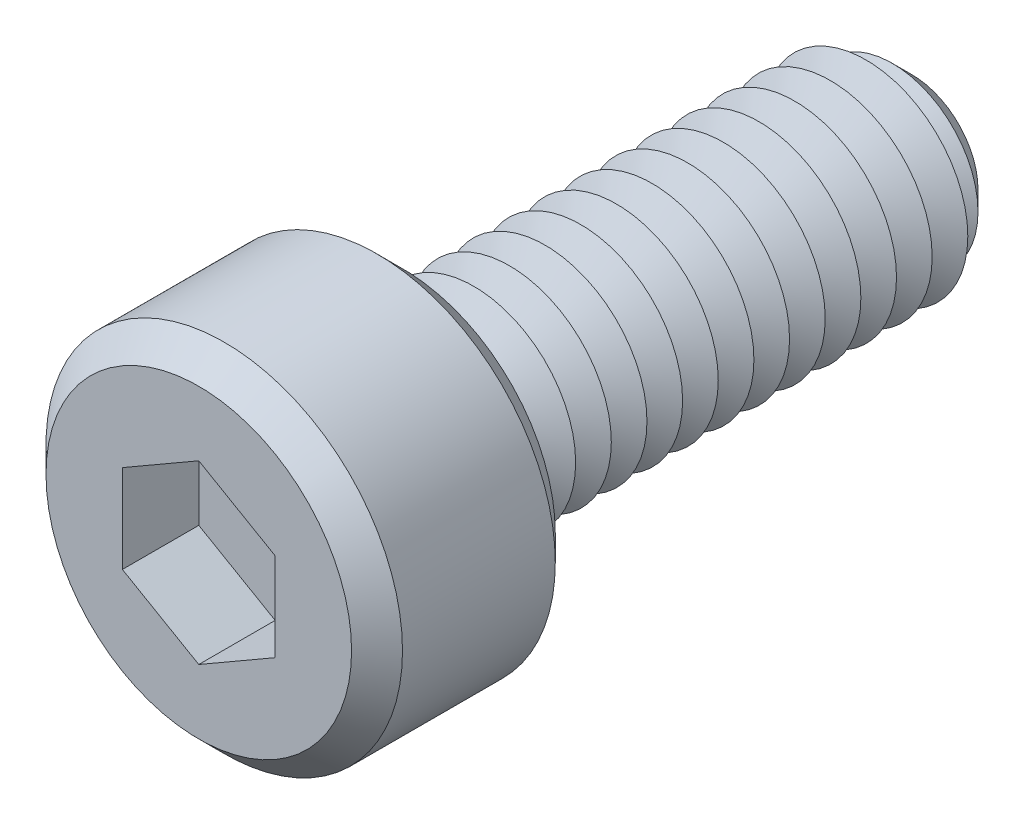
ISO-10303-21;
HEADER;
FILE_DESCRIPTION(('STEP AP214'),'2;1');
FILE_NAME('part.step','',(''),(''),'','','');
FILE_SCHEMA(('AUTOMOTIVE_DESIGN { 1 0 10303 214 1 1 1 1 }'));
ENDSEC;
DATA;
#1=APPLICATION_CONTEXT('core data for automotive mechanical design processes');
#2=APPLICATION_PROTOCOL_DEFINITION('international standard','automotive_design',2000,#1);
#3=PRODUCT_CONTEXT('',#1,'mechanical');
#4=PRODUCT('Part','Part','',(#3));
#5=PRODUCT_RELATED_PRODUCT_CATEGORY('part','',(#4));
#6=PRODUCT_DEFINITION_FORMATION('','',#4);
#7=PRODUCT_DEFINITION_CONTEXT('part definition',#1,'design');
#8=PRODUCT_DEFINITION('design','',#6,#7);
#9=PRODUCT_DEFINITION_SHAPE('','',#8);
#10=(LENGTH_UNIT() NAMED_UNIT(*) SI_UNIT(.MILLI.,.METRE.));
#11=(NAMED_UNIT(*) PLANE_ANGLE_UNIT() SI_UNIT($,.RADIAN.));
#12=(NAMED_UNIT(*) SI_UNIT($,.STERADIAN.) SOLID_ANGLE_UNIT());
#13=UNCERTAINTY_MEASURE_WITH_UNIT(LENGTH_MEASURE(1.E-05),#10,'distance_accuracy_value','');
#14=(GEOMETRIC_REPRESENTATION_CONTEXT(3) GLOBAL_UNCERTAINTY_ASSIGNED_CONTEXT((#13)) GLOBAL_UNIT_ASSIGNED_CONTEXT((#10,
#11,#12)) REPRESENTATION_CONTEXT('',''));
#15=CARTESIAN_POINT('',(0.,0.,0.));
#16=DIRECTION('',(0.,0.,1.));
#17=DIRECTION('',(1.,0.,0.));
#18=AXIS2_PLACEMENT_3D('',#15,#16,#17);
#19=CARTESIAN_POINT('',(0.,0.,4.));
#20=DIRECTION('',(0.,0.,-1.));
#21=DIRECTION('',(-1.,0.,0.));
#22=AXIS2_PLACEMENT_3D('',#19,#20,#21);
#23=CYLINDRICAL_SURFACE('',#22,3.5);
#24=CARTESIAN_POINT('',(0.,0.,0.500000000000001));
#25=DIRECTION('',(0.,0.,1.));
#26=DIRECTION('',(1.,0.,0.));
#27=AXIS2_PLACEMENT_3D('',#24,#25,#26);
#28=CIRCLE('',#27,3.5);
#29=CARTESIAN_POINT('',(3.5,0.,0.500000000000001));
#30=VERTEX_POINT('',#29);
#31=EDGE_CURVE('E289',#30,#30,#28,.T.);
#32=ORIENTED_EDGE('',*,*,#31,.T.);
#33=EDGE_LOOP('',(#32));
#34=FACE_BOUND('',#33,.T.);
#35=CARTESIAN_POINT('',(0.,0.,3.5));
#36=DIRECTION('',(0.,0.,1.));
#37=DIRECTION('',(1.,0.,0.));
#38=AXIS2_PLACEMENT_3D('',#35,#36,#37);
#39=CIRCLE('',#38,3.5);
#40=CARTESIAN_POINT('',(3.5,0.,3.5));
#41=VERTEX_POINT('',#40);
#42=EDGE_CURVE('E282',#41,#41,#39,.F.);
#43=ORIENTED_EDGE('',*,*,#42,.T.);
#44=EDGE_LOOP('',(#43));
#45=FACE_BOUND('',#44,.T.);
#46=ADVANCED_FACE('F39',(#34,#45),#23,.T.);
#47=CARTESIAN_POINT('',(0.,0.,4.));
#48=DIRECTION('',(0.,0.,1.));
#49=DIRECTION('',(1.,0.,0.));
#50=AXIS2_PLACEMENT_3D('',#47,#48,#49);
#51=PLANE('',#50);
#52=CARTESIAN_POINT('',(0.,0.,4.));
#53=DIRECTION('',(0.,0.,1.));
#54=DIRECTION('',(1.,0.,0.));
#55=AXIS2_PLACEMENT_3D('',#52,#53,#54);
#56=CIRCLE('',#55,3.);
#57=CARTESIAN_POINT('',(3.,0.,4.));
#58=VERTEX_POINT('',#57);
#59=EDGE_CURVE('E11',#58,#58,#56,.T.);
#60=ORIENTED_EDGE('',*,*,#59,.T.);
#61=EDGE_LOOP('',(#60));
#62=FACE_BOUND('',#61,.T.);
#63=DIRECTION('',(-0.866025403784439,0.5,0.));
#64=VECTOR('',#63,1.);
#65=CARTESIAN_POINT('',(1.5,0.866025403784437,4.));
#66=LINE('',#65,#64);
#67=CARTESIAN_POINT('',(1.5,0.866025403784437,4.));
#68=VERTEX_POINT('',#67);
#69=CARTESIAN_POINT('',(0.,1.73205080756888,4.));
#70=VERTEX_POINT('',#69);
#71=EDGE_CURVE('E55',#68,#70,#66,.T.);
#72=ORIENTED_EDGE('',*,*,#71,.F.);
#73=DIRECTION('',(0.,1.,0.));
#74=VECTOR('',#73,1.);
#75=CARTESIAN_POINT('',(1.5,-0.866025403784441,4.));
#76=LINE('',#75,#74);
#77=CARTESIAN_POINT('',(1.5,-0.866025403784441,4.));
#78=VERTEX_POINT('',#77);
#79=EDGE_CURVE('E151',#78,#68,#76,.T.);
#80=ORIENTED_EDGE('',*,*,#79,.F.);
#81=DIRECTION('',(0.866025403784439,0.5,0.));
#82=VECTOR('',#81,1.);
#83=CARTESIAN_POINT('',(0.,-1.73205080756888,4.));
#84=LINE('',#83,#82);
#85=CARTESIAN_POINT('',(0.,-1.73205080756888,4.));
#86=VERTEX_POINT('',#85);
#87=EDGE_CURVE('E148',#86,#78,#84,.T.);
#88=ORIENTED_EDGE('',*,*,#87,.F.);
#89=DIRECTION('',(0.866025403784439,-0.5,0.));
#90=VECTOR('',#89,1.);
#91=CARTESIAN_POINT('',(-1.5,-0.86602540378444,4.));
#92=LINE('',#91,#90);
#93=CARTESIAN_POINT('',(-1.5,-0.86602540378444,4.));
#94=VERTEX_POINT('',#93);
#95=EDGE_CURVE('E103',#94,#86,#92,.T.);
#96=ORIENTED_EDGE('',*,*,#95,.F.);
#97=DIRECTION('',(0.,-1.,0.));
#98=VECTOR('',#97,1.);
#99=CARTESIAN_POINT('',(-1.5,0.866025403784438,4.));
#100=LINE('',#99,#98);
#101=CARTESIAN_POINT('',(-1.5,0.866025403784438,4.));
#102=VERTEX_POINT('',#101);
#103=EDGE_CURVE('E142',#102,#94,#100,.T.);
#104=ORIENTED_EDGE('',*,*,#103,.F.);
#105=DIRECTION('',(-0.866025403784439,-0.5,0.));
#106=VECTOR('',#105,1.);
#107=CARTESIAN_POINT('',(0.,1.73205080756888,4.));
#108=LINE('',#107,#106);
#109=EDGE_CURVE('E137',#70,#102,#108,.T.);
#110=ORIENTED_EDGE('',*,*,#109,.F.);
#111=EDGE_LOOP('',(#72,#80,#88,#96,#104,#110));
#112=FACE_BOUND('',#111,.T.);
#113=ADVANCED_FACE('F306',(#62,#112),#51,.T.);
#114=CARTESIAN_POINT('',(0.,0.,0.));
#115=DIRECTION('',(0.,0.,1.));
#116=DIRECTION('',(1.,0.,0.));
#117=AXIS2_PLACEMENT_3D('',#114,#115,#116);
#118=PLANE('',#117);
#119=CARTESIAN_POINT('',(0.,0.,0.));
#120=DIRECTION('',(0.,0.,1.));
#121=DIRECTION('',(1.,0.,0.));
#122=AXIS2_PLACEMENT_3D('',#119,#120,#121);
#123=CIRCLE('',#122,3.);
#124=CARTESIAN_POINT('',(3.,0.,0.));
#125=VERTEX_POINT('',#124);
#126=EDGE_CURVE('E48',#125,#125,#123,.F.);
#127=ORIENTED_EDGE('',*,*,#126,.T.);
#128=EDGE_LOOP('',(#127));
#129=FACE_BOUND('',#128,.T.);
#130=CARTESIAN_POINT('',(0.,0.,0.));
#131=DIRECTION('',(0.,0.,1.));
#132=DIRECTION('',(1.,0.,0.));
#133=AXIS2_PLACEMENT_3D('',#130,#131,#132);
#134=CIRCLE('',#133,2.);
#135=CARTESIAN_POINT('',(2.,0.,0.));
#136=VERTEX_POINT('',#135);
#137=EDGE_CURVE('E274',#136,#136,#134,.T.);
#138=ORIENTED_EDGE('',*,*,#137,.T.);
#139=EDGE_LOOP('',(#138));
#140=FACE_BOUND('',#139,.T.);
#141=ADVANCED_FACE('F295',(#129,#140),#118,.F.);
#142=CARTESIAN_POINT('',(0.,0.,0.));
#143=DIRECTION('',(0.,0.,1.));
#144=DIRECTION('',(1.,0.,0.));
#145=AXIS2_PLACEMENT_3D('',#142,#143,#144);
#146=CONICAL_SURFACE('',#145,2.,1.0471975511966);
#147=CARTESIAN_POINT('',(0.,0.,-0.35));
#148=DIRECTION('',(0.,0.,1.));
#149=DIRECTION('',(1.,0.,0.));
#150=AXIS2_PLACEMENT_3D('',#147,#148,#149);
#151=CIRCLE('',#150,1.39378221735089);
#152=CARTESIAN_POINT('',(1.39378221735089,0.,-0.35));
#153=VERTEX_POINT('',#152);
#154=EDGE_CURVE('E270',#153,#153,#151,.T.);
#155=ORIENTED_EDGE('',*,*,#154,.T.);
#156=EDGE_LOOP('',(#155));
#157=FACE_BOUND('',#156,.T.);
#158=ORIENTED_EDGE('',*,*,#137,.F.);
#159=EDGE_LOOP('',(#158));
#160=FACE_BOUND('',#159,.T.);
#161=ADVANCED_FACE('F468',(#157,#160),#146,.T.);
#162=CARTESIAN_POINT('',(0.,0.,-0.35));
#163=DIRECTION('',(0.,0.,-1.));
#164=DIRECTION('',(-1.,0.,0.));
#165=AXIS2_PLACEMENT_3D('',#162,#163,#164);
#166=CONICAL_SURFACE('',#165,1.39378221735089,1.0471975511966);
#167=CARTESIAN_POINT('',(0.,0.,-0.7));
#168=DIRECTION('',(0.,0.,1.));
#169=DIRECTION('',(1.,0.,0.));
#170=AXIS2_PLACEMENT_3D('',#167,#168,#169);
#171=CIRCLE('',#170,2.);
#172=CARTESIAN_POINT('',(2.,0.,-0.7));
#173=VERTEX_POINT('',#172);
#174=EDGE_CURVE('E266',#173,#173,#171,.T.);
#175=ORIENTED_EDGE('',*,*,#174,.T.);
#176=EDGE_LOOP('',(#175));
#177=FACE_BOUND('',#176,.T.);
#178=ORIENTED_EDGE('',*,*,#154,.F.);
#179=EDGE_LOOP('',(#178));
#180=FACE_BOUND('',#179,.T.);
#181=ADVANCED_FACE('F464',(#177,#180),#166,.T.);
#182=CARTESIAN_POINT('',(0.,0.,-0.7));
#183=DIRECTION('',(0.,0.,1.));
#184=DIRECTION('',(1.,0.,0.));
#185=AXIS2_PLACEMENT_3D('',#182,#183,#184);
#186=CONICAL_SURFACE('',#185,2.,1.0471975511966);
#187=CARTESIAN_POINT('',(0.,0.,-1.05));
#188=DIRECTION('',(0.,0.,1.));
#189=DIRECTION('',(1.,0.,0.));
#190=AXIS2_PLACEMENT_3D('',#187,#188,#189);
#191=CIRCLE('',#190,1.39378221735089);
#192=CARTESIAN_POINT('',(1.39378221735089,0.,-1.05));
#193=VERTEX_POINT('',#192);
#194=EDGE_CURVE('E262',#193,#193,#191,.T.);
#195=ORIENTED_EDGE('',*,*,#194,.T.);
#196=EDGE_LOOP('',(#195));
#197=FACE_BOUND('',#196,.T.);
#198=ORIENTED_EDGE('',*,*,#174,.F.);
#199=EDGE_LOOP('',(#198));
#200=FACE_BOUND('',#199,.T.);
#201=ADVANCED_FACE('F460',(#197,#200),#186,.T.);
#202=CARTESIAN_POINT('',(0.,0.,-1.05));
#203=DIRECTION('',(0.,0.,-1.));
#204=DIRECTION('',(-1.,0.,0.));
#205=AXIS2_PLACEMENT_3D('',#202,#203,#204);
#206=CONICAL_SURFACE('',#205,1.39378221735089,1.0471975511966);
#207=CARTESIAN_POINT('',(0.,0.,-1.4));
#208=DIRECTION('',(0.,0.,1.));
#209=DIRECTION('',(1.,0.,0.));
#210=AXIS2_PLACEMENT_3D('',#207,#208,#209);
#211=CIRCLE('',#210,2.);
#212=CARTESIAN_POINT('',(2.,0.,-1.4));
#213=VERTEX_POINT('',#212);
#214=EDGE_CURVE('E258',#213,#213,#211,.T.);
#215=ORIENTED_EDGE('',*,*,#214,.T.);
#216=EDGE_LOOP('',(#215));
#217=FACE_BOUND('',#216,.T.);
#218=ORIENTED_EDGE('',*,*,#194,.F.);
#219=EDGE_LOOP('',(#218));
#220=FACE_BOUND('',#219,.T.);
#221=ADVANCED_FACE('F456',(#217,#220),#206,.T.);
#222=CARTESIAN_POINT('',(0.,0.,-1.4));
#223=DIRECTION('',(0.,0.,1.));
#224=DIRECTION('',(1.,0.,0.));
#225=AXIS2_PLACEMENT_3D('',#222,#223,#224);
#226=CONICAL_SURFACE('',#225,2.,1.0471975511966);
#227=CARTESIAN_POINT('',(0.,0.,-1.75));
#228=DIRECTION('',(0.,0.,1.));
#229=DIRECTION('',(1.,0.,0.));
#230=AXIS2_PLACEMENT_3D('',#227,#228,#229);
#231=CIRCLE('',#230,1.39378221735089);
#232=CARTESIAN_POINT('',(1.39378221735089,0.,-1.75));
#233=VERTEX_POINT('',#232);
#234=EDGE_CURVE('E254',#233,#233,#231,.T.);
#235=ORIENTED_EDGE('',*,*,#234,.T.);
#236=EDGE_LOOP('',(#235));
#237=FACE_BOUND('',#236,.T.);
#238=ORIENTED_EDGE('',*,*,#214,.F.);
#239=EDGE_LOOP('',(#238));
#240=FACE_BOUND('',#239,.T.);
#241=ADVANCED_FACE('F452',(#237,#240),#226,.T.);
#242=CARTESIAN_POINT('',(0.,0.,-1.75));
#243=DIRECTION('',(0.,0.,-1.));
#244=DIRECTION('',(-1.,0.,0.));
#245=AXIS2_PLACEMENT_3D('',#242,#243,#244);
#246=CONICAL_SURFACE('',#245,1.39378221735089,1.0471975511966);
#247=CARTESIAN_POINT('',(0.,0.,-2.1));
#248=DIRECTION('',(0.,0.,1.));
#249=DIRECTION('',(1.,0.,0.));
#250=AXIS2_PLACEMENT_3D('',#247,#248,#249);
#251=CIRCLE('',#250,2.);
#252=CARTESIAN_POINT('',(2.,0.,-2.1));
#253=VERTEX_POINT('',#252);
#254=EDGE_CURVE('E250',#253,#253,#251,.T.);
#255=ORIENTED_EDGE('',*,*,#254,.T.);
#256=EDGE_LOOP('',(#255));
#257=FACE_BOUND('',#256,.T.);
#258=ORIENTED_EDGE('',*,*,#234,.F.);
#259=EDGE_LOOP('',(#258));
#260=FACE_BOUND('',#259,.T.);
#261=ADVANCED_FACE('F448',(#257,#260),#246,.T.);
#262=CARTESIAN_POINT('',(0.,0.,-2.1));
#263=DIRECTION('',(0.,0.,1.));
#264=DIRECTION('',(1.,0.,0.));
#265=AXIS2_PLACEMENT_3D('',#262,#263,#264);
#266=CONICAL_SURFACE('',#265,2.,1.0471975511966);
#267=CARTESIAN_POINT('',(0.,0.,-2.45));
#268=DIRECTION('',(0.,0.,1.));
#269=DIRECTION('',(1.,0.,0.));
#270=AXIS2_PLACEMENT_3D('',#267,#268,#269);
#271=CIRCLE('',#270,1.39378221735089);
#272=CARTESIAN_POINT('',(1.39378221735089,0.,-2.45));
#273=VERTEX_POINT('',#272);
#274=EDGE_CURVE('E246',#273,#273,#271,.T.);
#275=ORIENTED_EDGE('',*,*,#274,.T.);
#276=EDGE_LOOP('',(#275));
#277=FACE_BOUND('',#276,.T.);
#278=ORIENTED_EDGE('',*,*,#254,.F.);
#279=EDGE_LOOP('',(#278));
#280=FACE_BOUND('',#279,.T.);
#281=ADVANCED_FACE('F444',(#277,#280),#266,.T.);
#282=CARTESIAN_POINT('',(0.,0.,-2.45));
#283=DIRECTION('',(0.,0.,-1.));
#284=DIRECTION('',(-1.,0.,0.));
#285=AXIS2_PLACEMENT_3D('',#282,#283,#284);
#286=CONICAL_SURFACE('',#285,1.39378221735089,1.0471975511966);
#287=CARTESIAN_POINT('',(0.,0.,-2.8));
#288=DIRECTION('',(0.,0.,1.));
#289=DIRECTION('',(1.,0.,0.));
#290=AXIS2_PLACEMENT_3D('',#287,#288,#289);
#291=CIRCLE('',#290,2.);
#292=CARTESIAN_POINT('',(2.,0.,-2.8));
#293=VERTEX_POINT('',#292);
#294=EDGE_CURVE('E242',#293,#293,#291,.T.);
#295=ORIENTED_EDGE('',*,*,#294,.T.);
#296=EDGE_LOOP('',(#295));
#297=FACE_BOUND('',#296,.T.);
#298=ORIENTED_EDGE('',*,*,#274,.F.);
#299=EDGE_LOOP('',(#298));
#300=FACE_BOUND('',#299,.T.);
#301=ADVANCED_FACE('F440',(#297,#300),#286,.T.);
#302=CARTESIAN_POINT('',(0.,0.,-2.8));
#303=DIRECTION('',(0.,0.,1.));
#304=DIRECTION('',(1.,0.,0.));
#305=AXIS2_PLACEMENT_3D('',#302,#303,#304);
#306=CONICAL_SURFACE('',#305,2.,1.0471975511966);
#307=CARTESIAN_POINT('',(0.,0.,-3.15));
#308=DIRECTION('',(0.,0.,1.));
#309=DIRECTION('',(1.,0.,0.));
#310=AXIS2_PLACEMENT_3D('',#307,#308,#309);
#311=CIRCLE('',#310,1.39378221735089);
#312=CARTESIAN_POINT('',(1.39378221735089,0.,-3.15));
#313=VERTEX_POINT('',#312);
#314=EDGE_CURVE('E238',#313,#313,#311,.T.);
#315=ORIENTED_EDGE('',*,*,#314,.T.);
#316=EDGE_LOOP('',(#315));
#317=FACE_BOUND('',#316,.T.);
#318=ORIENTED_EDGE('',*,*,#294,.F.);
#319=EDGE_LOOP('',(#318));
#320=FACE_BOUND('',#319,.T.);
#321=ADVANCED_FACE('F436',(#317,#320),#306,.T.);
#322=CARTESIAN_POINT('',(0.,0.,-3.15));
#323=DIRECTION('',(0.,0.,-1.));
#324=DIRECTION('',(-1.,0.,0.));
#325=AXIS2_PLACEMENT_3D('',#322,#323,#324);
#326=CONICAL_SURFACE('',#325,1.39378221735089,1.0471975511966);
#327=CARTESIAN_POINT('',(0.,0.,-3.5));
#328=DIRECTION('',(0.,0.,1.));
#329=DIRECTION('',(1.,0.,0.));
#330=AXIS2_PLACEMENT_3D('',#327,#328,#329);
#331=CIRCLE('',#330,2.);
#332=CARTESIAN_POINT('',(2.,0.,-3.5));
#333=VERTEX_POINT('',#332);
#334=EDGE_CURVE('E234',#333,#333,#331,.T.);
#335=ORIENTED_EDGE('',*,*,#334,.T.);
#336=EDGE_LOOP('',(#335));
#337=FACE_BOUND('',#336,.T.);
#338=ORIENTED_EDGE('',*,*,#314,.F.);
#339=EDGE_LOOP('',(#338));
#340=FACE_BOUND('',#339,.T.);
#341=ADVANCED_FACE('F432',(#337,#340),#326,.T.);
#342=CARTESIAN_POINT('',(0.,0.,-3.5));
#343=DIRECTION('',(0.,0.,1.));
#344=DIRECTION('',(1.,0.,0.));
#345=AXIS2_PLACEMENT_3D('',#342,#343,#344);
#346=CONICAL_SURFACE('',#345,2.,1.0471975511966);
#347=CARTESIAN_POINT('',(0.,0.,-3.85));
#348=DIRECTION('',(0.,0.,1.));
#349=DIRECTION('',(1.,0.,0.));
#350=AXIS2_PLACEMENT_3D('',#347,#348,#349);
#351=CIRCLE('',#350,1.39378221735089);
#352=CARTESIAN_POINT('',(1.39378221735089,0.,-3.85));
#353=VERTEX_POINT('',#352);
#354=EDGE_CURVE('E230',#353,#353,#351,.T.);
#355=ORIENTED_EDGE('',*,*,#354,.T.);
#356=EDGE_LOOP('',(#355));
#357=FACE_BOUND('',#356,.T.);
#358=ORIENTED_EDGE('',*,*,#334,.F.);
#359=EDGE_LOOP('',(#358));
#360=FACE_BOUND('',#359,.T.);
#361=ADVANCED_FACE('F428',(#357,#360),#346,.T.);
#362=CARTESIAN_POINT('',(0.,0.,-3.85));
#363=DIRECTION('',(0.,0.,-1.));
#364=DIRECTION('',(-1.,0.,0.));
#365=AXIS2_PLACEMENT_3D('',#362,#363,#364);
#366=CONICAL_SURFACE('',#365,1.39378221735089,1.0471975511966);
#367=CARTESIAN_POINT('',(0.,0.,-4.2));
#368=DIRECTION('',(0.,0.,1.));
#369=DIRECTION('',(1.,0.,0.));
#370=AXIS2_PLACEMENT_3D('',#367,#368,#369);
#371=CIRCLE('',#370,2.);
#372=CARTESIAN_POINT('',(2.,0.,-4.2));
#373=VERTEX_POINT('',#372);
#374=EDGE_CURVE('E226',#373,#373,#371,.T.);
#375=ORIENTED_EDGE('',*,*,#374,.T.);
#376=EDGE_LOOP('',(#375));
#377=FACE_BOUND('',#376,.T.);
#378=ORIENTED_EDGE('',*,*,#354,.F.);
#379=EDGE_LOOP('',(#378));
#380=FACE_BOUND('',#379,.T.);
#381=ADVANCED_FACE('F424',(#377,#380),#366,.T.);
#382=CARTESIAN_POINT('',(0.,0.,-4.2));
#383=DIRECTION('',(0.,0.,1.));
#384=DIRECTION('',(1.,0.,0.));
#385=AXIS2_PLACEMENT_3D('',#382,#383,#384);
#386=CONICAL_SURFACE('',#385,2.,1.0471975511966);
#387=CARTESIAN_POINT('',(0.,0.,-4.55));
#388=DIRECTION('',(0.,0.,1.));
#389=DIRECTION('',(1.,0.,0.));
#390=AXIS2_PLACEMENT_3D('',#387,#388,#389);
#391=CIRCLE('',#390,1.39378221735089);
#392=CARTESIAN_POINT('',(1.39378221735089,0.,-4.55));
#393=VERTEX_POINT('',#392);
#394=EDGE_CURVE('E222',#393,#393,#391,.T.);
#395=ORIENTED_EDGE('',*,*,#394,.T.);
#396=EDGE_LOOP('',(#395));
#397=FACE_BOUND('',#396,.T.);
#398=ORIENTED_EDGE('',*,*,#374,.F.);
#399=EDGE_LOOP('',(#398));
#400=FACE_BOUND('',#399,.T.);
#401=ADVANCED_FACE('F420',(#397,#400),#386,.T.);
#402=CARTESIAN_POINT('',(0.,0.,-4.55));
#403=DIRECTION('',(0.,0.,-1.));
#404=DIRECTION('',(-1.,0.,0.));
#405=AXIS2_PLACEMENT_3D('',#402,#403,#404);
#406=CONICAL_SURFACE('',#405,1.39378221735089,1.0471975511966);
#407=CARTESIAN_POINT('',(0.,0.,-4.9));
#408=DIRECTION('',(0.,0.,1.));
#409=DIRECTION('',(1.,0.,0.));
#410=AXIS2_PLACEMENT_3D('',#407,#408,#409);
#411=CIRCLE('',#410,2.);
#412=CARTESIAN_POINT('',(2.,0.,-4.9));
#413=VERTEX_POINT('',#412);
#414=EDGE_CURVE('E218',#413,#413,#411,.T.);
#415=ORIENTED_EDGE('',*,*,#414,.T.);
#416=EDGE_LOOP('',(#415));
#417=FACE_BOUND('',#416,.T.);
#418=ORIENTED_EDGE('',*,*,#394,.F.);
#419=EDGE_LOOP('',(#418));
#420=FACE_BOUND('',#419,.T.);
#421=ADVANCED_FACE('F416',(#417,#420),#406,.T.);
#422=CARTESIAN_POINT('',(0.,0.,-4.9));
#423=DIRECTION('',(0.,0.,1.));
#424=DIRECTION('',(1.,0.,0.));
#425=AXIS2_PLACEMENT_3D('',#422,#423,#424);
#426=CONICAL_SURFACE('',#425,2.,1.0471975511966);
#427=CARTESIAN_POINT('',(0.,0.,-5.25));
#428=DIRECTION('',(0.,0.,1.));
#429=DIRECTION('',(1.,0.,0.));
#430=AXIS2_PLACEMENT_3D('',#427,#428,#429);
#431=CIRCLE('',#430,1.39378221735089);
#432=CARTESIAN_POINT('',(1.39378221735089,0.,-5.25));
#433=VERTEX_POINT('',#432);
#434=EDGE_CURVE('E214',#433,#433,#431,.T.);
#435=ORIENTED_EDGE('',*,*,#434,.T.);
#436=EDGE_LOOP('',(#435));
#437=FACE_BOUND('',#436,.T.);
#438=ORIENTED_EDGE('',*,*,#414,.F.);
#439=EDGE_LOOP('',(#438));
#440=FACE_BOUND('',#439,.T.);
#441=ADVANCED_FACE('F412',(#437,#440),#426,.T.);
#442=CARTESIAN_POINT('',(0.,0.,-5.25));
#443=DIRECTION('',(0.,0.,-1.));
#444=DIRECTION('',(-1.,0.,0.));
#445=AXIS2_PLACEMENT_3D('',#442,#443,#444);
#446=CONICAL_SURFACE('',#445,1.39378221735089,1.0471975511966);
#447=CARTESIAN_POINT('',(0.,0.,-5.6));
#448=DIRECTION('',(0.,0.,1.));
#449=DIRECTION('',(1.,0.,0.));
#450=AXIS2_PLACEMENT_3D('',#447,#448,#449);
#451=CIRCLE('',#450,2.);
#452=CARTESIAN_POINT('',(2.,0.,-5.6));
#453=VERTEX_POINT('',#452);
#454=EDGE_CURVE('E210',#453,#453,#451,.T.);
#455=ORIENTED_EDGE('',*,*,#454,.T.);
#456=EDGE_LOOP('',(#455));
#457=FACE_BOUND('',#456,.T.);
#458=ORIENTED_EDGE('',*,*,#434,.F.);
#459=EDGE_LOOP('',(#458));
#460=FACE_BOUND('',#459,.T.);
#461=ADVANCED_FACE('F408',(#457,#460),#446,.T.);
#462=CARTESIAN_POINT('',(0.,0.,-5.6));
#463=DIRECTION('',(0.,0.,1.));
#464=DIRECTION('',(1.,0.,0.));
#465=AXIS2_PLACEMENT_3D('',#462,#463,#464);
#466=CONICAL_SURFACE('',#465,2.,1.0471975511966);
#467=CARTESIAN_POINT('',(0.,0.,-5.95));
#468=DIRECTION('',(0.,0.,1.));
#469=DIRECTION('',(1.,0.,0.));
#470=AXIS2_PLACEMENT_3D('',#467,#468,#469);
#471=CIRCLE('',#470,1.39378221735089);
#472=CARTESIAN_POINT('',(1.39378221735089,0.,-5.95));
#473=VERTEX_POINT('',#472);
#474=EDGE_CURVE('E206',#473,#473,#471,.T.);
#475=ORIENTED_EDGE('',*,*,#474,.T.);
#476=EDGE_LOOP('',(#475));
#477=FACE_BOUND('',#476,.T.);
#478=ORIENTED_EDGE('',*,*,#454,.F.);
#479=EDGE_LOOP('',(#478));
#480=FACE_BOUND('',#479,.T.);
#481=ADVANCED_FACE('F404',(#477,#480),#466,.T.);
#482=CARTESIAN_POINT('',(0.,0.,-5.95));
#483=DIRECTION('',(0.,0.,-1.));
#484=DIRECTION('',(-1.,0.,0.));
#485=AXIS2_PLACEMENT_3D('',#482,#483,#484);
#486=CONICAL_SURFACE('',#485,1.39378221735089,1.0471975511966);
#487=CARTESIAN_POINT('',(0.,0.,-6.3));
#488=DIRECTION('',(0.,0.,1.));
#489=DIRECTION('',(1.,0.,0.));
#490=AXIS2_PLACEMENT_3D('',#487,#488,#489);
#491=CIRCLE('',#490,2.);
#492=CARTESIAN_POINT('',(2.,0.,-6.3));
#493=VERTEX_POINT('',#492);
#494=EDGE_CURVE('E202',#493,#493,#491,.T.);
#495=ORIENTED_EDGE('',*,*,#494,.T.);
#496=EDGE_LOOP('',(#495));
#497=FACE_BOUND('',#496,.T.);
#498=ORIENTED_EDGE('',*,*,#474,.F.);
#499=EDGE_LOOP('',(#498));
#500=FACE_BOUND('',#499,.T.);
#501=ADVANCED_FACE('F400',(#497,#500),#486,.T.);
#502=CARTESIAN_POINT('',(0.,0.,-6.3));
#503=DIRECTION('',(0.,0.,1.));
#504=DIRECTION('',(1.,0.,0.));
#505=AXIS2_PLACEMENT_3D('',#502,#503,#504);
#506=CONICAL_SURFACE('',#505,2.,1.0471975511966);
#507=CARTESIAN_POINT('',(0.,0.,-6.65));
#508=DIRECTION('',(0.,0.,1.));
#509=DIRECTION('',(1.,0.,0.));
#510=AXIS2_PLACEMENT_3D('',#507,#508,#509);
#511=CIRCLE('',#510,1.39378221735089);
#512=CARTESIAN_POINT('',(1.39378221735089,0.,-6.65));
#513=VERTEX_POINT('',#512);
#514=EDGE_CURVE('E198',#513,#513,#511,.T.);
#515=ORIENTED_EDGE('',*,*,#514,.T.);
#516=EDGE_LOOP('',(#515));
#517=FACE_BOUND('',#516,.T.);
#518=ORIENTED_EDGE('',*,*,#494,.F.);
#519=EDGE_LOOP('',(#518));
#520=FACE_BOUND('',#519,.T.);
#521=ADVANCED_FACE('F396',(#517,#520),#506,.T.);
#522=CARTESIAN_POINT('',(0.,0.,-6.65));
#523=DIRECTION('',(0.,0.,-1.));
#524=DIRECTION('',(-1.,0.,0.));
#525=AXIS2_PLACEMENT_3D('',#522,#523,#524);
#526=CONICAL_SURFACE('',#525,1.39378221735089,1.0471975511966);
#527=CARTESIAN_POINT('',(0.,0.,-7.));
#528=DIRECTION('',(0.,0.,1.));
#529=DIRECTION('',(1.,0.,0.));
#530=AXIS2_PLACEMENT_3D('',#527,#528,#529);
#531=CIRCLE('',#530,2.);
#532=CARTESIAN_POINT('',(2.,0.,-7.));
#533=VERTEX_POINT('',#532);
#534=EDGE_CURVE('E194',#533,#533,#531,.T.);
#535=ORIENTED_EDGE('',*,*,#534,.T.);
#536=EDGE_LOOP('',(#535));
#537=FACE_BOUND('',#536,.T.);
#538=ORIENTED_EDGE('',*,*,#514,.F.);
#539=EDGE_LOOP('',(#538));
#540=FACE_BOUND('',#539,.T.);
#541=ADVANCED_FACE('F392',(#537,#540),#526,.T.);
#542=CARTESIAN_POINT('',(0.,0.,-7.));
#543=DIRECTION('',(0.,0.,1.));
#544=DIRECTION('',(1.,0.,0.));
#545=AXIS2_PLACEMENT_3D('',#542,#543,#544);
#546=CONICAL_SURFACE('',#545,2.,1.0471975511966);
#547=CARTESIAN_POINT('',(0.,0.,-7.35));
#548=DIRECTION('',(0.,0.,1.));
#549=DIRECTION('',(1.,0.,0.));
#550=AXIS2_PLACEMENT_3D('',#547,#548,#549);
#551=CIRCLE('',#550,1.39378221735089);
#552=CARTESIAN_POINT('',(1.39378221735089,0.,-7.35));
#553=VERTEX_POINT('',#552);
#554=EDGE_CURVE('E190',#553,#553,#551,.T.);
#555=ORIENTED_EDGE('',*,*,#554,.T.);
#556=EDGE_LOOP('',(#555));
#557=FACE_BOUND('',#556,.T.);
#558=ORIENTED_EDGE('',*,*,#534,.F.);
#559=EDGE_LOOP('',(#558));
#560=FACE_BOUND('',#559,.T.);
#561=ADVANCED_FACE('F388',(#557,#560),#546,.T.);
#562=CARTESIAN_POINT('',(0.,0.,-7.35));
#563=DIRECTION('',(0.,0.,-1.));
#564=DIRECTION('',(-1.,0.,0.));
#565=AXIS2_PLACEMENT_3D('',#562,#563,#564);
#566=CONICAL_SURFACE('',#565,1.39378221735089,1.0471975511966);
#567=CARTESIAN_POINT('',(0.,0.,-7.7));
#568=DIRECTION('',(0.,0.,1.));
#569=DIRECTION('',(1.,0.,0.));
#570=AXIS2_PLACEMENT_3D('',#567,#568,#569);
#571=CIRCLE('',#570,2.);
#572=CARTESIAN_POINT('',(2.,0.,-7.7));
#573=VERTEX_POINT('',#572);
#574=EDGE_CURVE('E186',#573,#573,#571,.T.);
#575=ORIENTED_EDGE('',*,*,#574,.T.);
#576=EDGE_LOOP('',(#575));
#577=FACE_BOUND('',#576,.T.);
#578=ORIENTED_EDGE('',*,*,#554,.F.);
#579=EDGE_LOOP('',(#578));
#580=FACE_BOUND('',#579,.T.);
#581=ADVANCED_FACE('F384',(#577,#580),#566,.T.);
#582=CARTESIAN_POINT('',(0.,0.,-7.7));
#583=DIRECTION('',(0.,0.,1.));
#584=DIRECTION('',(1.,0.,0.));
#585=AXIS2_PLACEMENT_3D('',#582,#583,#584);
#586=CONICAL_SURFACE('',#585,2.,1.0471975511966);
#587=CARTESIAN_POINT('',(0.,0.,-8.05));
#588=DIRECTION('',(0.,0.,1.));
#589=DIRECTION('',(1.,0.,0.));
#590=AXIS2_PLACEMENT_3D('',#587,#588,#589);
#591=CIRCLE('',#590,1.39378221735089);
#592=CARTESIAN_POINT('',(1.39378221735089,0.,-8.05));
#593=VERTEX_POINT('',#592);
#594=EDGE_CURVE('E182',#593,#593,#591,.T.);
#595=ORIENTED_EDGE('',*,*,#594,.T.);
#596=EDGE_LOOP('',(#595));
#597=FACE_BOUND('',#596,.T.);
#598=ORIENTED_EDGE('',*,*,#574,.F.);
#599=EDGE_LOOP('',(#598));
#600=FACE_BOUND('',#599,.T.);
#601=ADVANCED_FACE('F380',(#597,#600),#586,.T.);
#602=CARTESIAN_POINT('',(0.,0.,-8.05));
#603=DIRECTION('',(0.,0.,-1.));
#604=DIRECTION('',(-1.,0.,0.));
#605=AXIS2_PLACEMENT_3D('',#602,#603,#604);
#606=CONICAL_SURFACE('',#605,1.39378221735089,1.0471975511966);
#607=CARTESIAN_POINT('',(0.,0.,-8.4));
#608=DIRECTION('',(0.,0.,1.));
#609=DIRECTION('',(1.,0.,0.));
#610=AXIS2_PLACEMENT_3D('',#607,#608,#609);
#611=CIRCLE('',#610,2.);
#612=CARTESIAN_POINT('',(2.,0.,-8.4));
#613=VERTEX_POINT('',#612);
#614=EDGE_CURVE('E178',#613,#613,#611,.T.);
#615=ORIENTED_EDGE('',*,*,#614,.T.);
#616=EDGE_LOOP('',(#615));
#617=FACE_BOUND('',#616,.T.);
#618=ORIENTED_EDGE('',*,*,#594,.F.);
#619=EDGE_LOOP('',(#618));
#620=FACE_BOUND('',#619,.T.);
#621=ADVANCED_FACE('F376',(#617,#620),#606,.T.);
#622=CARTESIAN_POINT('',(0.,0.,-8.4));
#623=DIRECTION('',(0.,0.,1.));
#624=DIRECTION('',(1.,0.,0.));
#625=AXIS2_PLACEMENT_3D('',#622,#623,#624);
#626=CONICAL_SURFACE('',#625,2.,1.0471975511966);
#627=CARTESIAN_POINT('',(0.,0.,-8.75));
#628=DIRECTION('',(0.,0.,1.));
#629=DIRECTION('',(1.,0.,0.));
#630=AXIS2_PLACEMENT_3D('',#627,#628,#629);
#631=CIRCLE('',#630,1.39378221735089);
#632=CARTESIAN_POINT('',(1.39378221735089,0.,-8.75));
#633=VERTEX_POINT('',#632);
#634=EDGE_CURVE('E174',#633,#633,#631,.T.);
#635=ORIENTED_EDGE('',*,*,#634,.T.);
#636=EDGE_LOOP('',(#635));
#637=FACE_BOUND('',#636,.T.);
#638=ORIENTED_EDGE('',*,*,#614,.F.);
#639=EDGE_LOOP('',(#638));
#640=FACE_BOUND('',#639,.T.);
#641=ADVANCED_FACE('F372',(#637,#640),#626,.T.);
#642=CARTESIAN_POINT('',(0.,0.,-8.75));
#643=DIRECTION('',(0.,0.,-1.));
#644=DIRECTION('',(-1.,0.,0.));
#645=AXIS2_PLACEMENT_3D('',#642,#643,#644);
#646=CONICAL_SURFACE('',#645,1.39378221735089,1.0471975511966);
#647=CARTESIAN_POINT('',(0.,0.,-9.1));
#648=DIRECTION('',(0.,0.,1.));
#649=DIRECTION('',(1.,0.,0.));
#650=AXIS2_PLACEMENT_3D('',#647,#648,#649);
#651=CIRCLE('',#650,2.);
#652=CARTESIAN_POINT('',(2.,0.,-9.1));
#653=VERTEX_POINT('',#652);
#654=EDGE_CURVE('E169',#653,#653,#651,.T.);
#655=ORIENTED_EDGE('',*,*,#654,.T.);
#656=EDGE_LOOP('',(#655));
#657=FACE_BOUND('',#656,.T.);
#658=ORIENTED_EDGE('',*,*,#634,.F.);
#659=EDGE_LOOP('',(#658));
#660=FACE_BOUND('',#659,.T.);
#661=ADVANCED_FACE('F368',(#657,#660),#646,.T.);
#662=CARTESIAN_POINT('',(0.,0.,-9.1));
#663=DIRECTION('',(0.,0.,1.));
#664=DIRECTION('',(1.,0.,0.));
#665=AXIS2_PLACEMENT_3D('',#662,#663,#664);
#666=CONICAL_SURFACE('',#665,2.,1.0471975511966);
#667=CARTESIAN_POINT('',(0.,0.,-9.45));
#668=DIRECTION('',(0.,0.,1.));
#669=DIRECTION('',(1.,0.,0.));
#670=AXIS2_PLACEMENT_3D('',#667,#668,#669);
#671=CIRCLE('',#670,1.39378221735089);
#672=CARTESIAN_POINT('',(1.39378221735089,0.,-9.45));
#673=VERTEX_POINT('',#672);
#674=EDGE_CURVE('E157',#673,#673,#671,.T.);
#675=ORIENTED_EDGE('',*,*,#674,.T.);
#676=EDGE_LOOP('',(#675));
#677=FACE_BOUND('',#676,.T.);
#678=ORIENTED_EDGE('',*,*,#654,.F.);
#679=EDGE_LOOP('',(#678));
#680=FACE_BOUND('',#679,.T.);
#681=ADVANCED_FACE('F364',(#677,#680),#666,.T.);
#682=CARTESIAN_POINT('',(0.,0.,-9.45));
#683=DIRECTION('',(0.,0.,-1.));
#684=DIRECTION('',(-1.,0.,0.));
#685=AXIS2_PLACEMENT_3D('',#682,#683,#684);
#686=CONICAL_SURFACE('',#685,1.39378221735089,1.0471975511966);
#687=CARTESIAN_POINT('',(0.,0.,-9.61698729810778));
#688=DIRECTION('',(0.,0.,-1.));
#689=DIRECTION('',(-1.,0.,0.));
#690=AXIS2_PLACEMENT_3D('',#687,#688,#689);
#691=CIRCLE('',#690,1.68301270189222);
#692=CARTESIAN_POINT('',(1.68301270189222,0.,-9.61698729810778));
#693=VERTEX_POINT('',#692);
#694=EDGE_CURVE('E173',#693,#693,#691,.T.);
#695=ORIENTED_EDGE('',*,*,#694,.F.);
#696=EDGE_LOOP('',(#695));
#697=FACE_BOUND('',#696,.T.);
#698=ORIENTED_EDGE('',*,*,#674,.F.);
#699=EDGE_LOOP('',(#698));
#700=FACE_BOUND('',#699,.T.);
#701=ADVANCED_FACE('F360',(#697,#700),#686,.T.);
#702=CARTESIAN_POINT('',(0.,0.,-10.));
#703=DIRECTION('',(0.,0.,-1.));
#704=DIRECTION('',(-1.,0.,0.));
#705=AXIS2_PLACEMENT_3D('',#702,#703,#704);
#706=PLANE('',#705);
#707=CARTESIAN_POINT('',(0.,0.,-10.));
#708=DIRECTION('',(0.,0.,-1.));
#709=DIRECTION('',(-1.,0.,0.));
#710=AXIS2_PLACEMENT_3D('',#707,#708,#709);
#711=CIRCLE('',#710,0.5);
#712=CARTESIAN_POINT('',(-0.5,0.,-10.));
#713=VERTEX_POINT('',#712);
#714=EDGE_CURVE('E138',#713,#713,#711,.F.);
#715=ORIENTED_EDGE('',*,*,#714,.T.);
#716=EDGE_LOOP('',(#715));
#717=FACE_BOUND('',#716,.T.);
#718=CARTESIAN_POINT('',(0.,0.,-10.));
#719=DIRECTION('',(0.,0.,-1.));
#720=DIRECTION('',(-1.,0.,0.));
#721=AXIS2_PLACEMENT_3D('',#718,#719,#720);
#722=CIRCLE('',#721,1.3);
#723=CARTESIAN_POINT('',(1.30000000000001,0.,-10.));
#724=VERTEX_POINT('',#723);
#725=EDGE_CURVE('E278',#724,#724,#722,.T.);
#726=ORIENTED_EDGE('',*,*,#725,.T.);
#727=EDGE_LOOP('',(#726));
#728=FACE_BOUND('',#727,.T.);
#729=ADVANCED_FACE('F363',(#717,#728),#706,.T.);
#730=CARTESIAN_POINT('',(0.,0.,-10.));
#731=DIRECTION('',(0.,0.,1.));
#732=DIRECTION('',(1.,0.,0.));
#733=AXIS2_PLACEMENT_3D('',#730,#731,#732);
#734=CONICAL_SURFACE('',#733,1.3,0.785398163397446);
#735=CARTESIAN_POINT('',(1.30000000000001,0.,-10.));
#736=CARTESIAN_POINT('',(1.30398971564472,0.,-9.99601028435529));
#737=CARTESIAN_POINT('',(1.30797943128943,0.,-9.99202056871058));
#738=CARTESIAN_POINT('',(1.31595886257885,0.,-9.98404113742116));
#739=CARTESIAN_POINT('',(1.31994857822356,0.,-9.98005142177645));
#740=CARTESIAN_POINT('',(1.32792800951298,0.,-9.97207199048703));
#741=CARTESIAN_POINT('',(1.33191772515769,0.,-9.96808227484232));
#742=CARTESIAN_POINT('',(1.33989715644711,0.,-9.96010284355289));
#743=CARTESIAN_POINT('',(1.34388687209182,0.,-9.95611312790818));
#744=CARTESIAN_POINT('',(1.35186630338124,0.,-9.94813369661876));
#745=CARTESIAN_POINT('',(1.35585601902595,0.,-9.94414398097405));
#746=CARTESIAN_POINT('',(1.36383545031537,0.,-9.93616454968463));
#747=CARTESIAN_POINT('',(1.36782516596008,0.,-9.93217483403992));
#748=CARTESIAN_POINT('',(1.37580459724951,0.,-9.9241954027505));
#749=CARTESIAN_POINT('',(1.37979431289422,0.,-9.92020568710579));
#750=CARTESIAN_POINT('',(1.38777374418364,0.,-9.91222625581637));
#751=CARTESIAN_POINT('',(1.39176345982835,0.,-9.90823654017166));
#752=CARTESIAN_POINT('',(1.39974289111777,0.,-9.90025710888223));
#753=CARTESIAN_POINT('',(1.40373260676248,0.,-9.89626739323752));
#754=CARTESIAN_POINT('',(1.4117120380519,0.,-9.8882879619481));
#755=CARTESIAN_POINT('',(1.41570175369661,0.,-9.88429824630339));
#756=CARTESIAN_POINT('',(1.42368118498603,0.,-9.87631881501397));
#757=CARTESIAN_POINT('',(1.42767090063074,0.,-9.87232909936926));
#758=CARTESIAN_POINT('',(1.43565033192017,0.,-9.86434966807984));
#759=CARTESIAN_POINT('',(1.43964004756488,0.,-9.86035995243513));
#760=CARTESIAN_POINT('',(1.4476194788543,0.,-9.85238052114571));
#761=CARTESIAN_POINT('',(1.45160919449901,0.,-9.848390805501));
#762=CARTESIAN_POINT('',(1.45958862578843,0.,-9.84041137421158));
#763=CARTESIAN_POINT('',(1.46357834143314,0.,-9.83642165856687));
#764=CARTESIAN_POINT('',(1.47155777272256,0.,-9.82844222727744));
#765=CARTESIAN_POINT('',(1.47554748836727,0.,-9.82445251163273));
#766=CARTESIAN_POINT('',(1.48352691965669,0.,-9.81647308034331));
#767=CARTESIAN_POINT('',(1.4875166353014,0.,-9.8124833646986));
#768=CARTESIAN_POINT('',(1.49549606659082,0.,-9.80450393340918));
#769=CARTESIAN_POINT('',(1.49948578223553,0.,-9.80051421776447));
#770=CARTESIAN_POINT('',(1.50746521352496,0.,-9.79253478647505));
#771=CARTESIAN_POINT('',(1.51145492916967,0.,-9.78854507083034));
#772=CARTESIAN_POINT('',(1.51943436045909,0.,-9.78056563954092));
#773=CARTESIAN_POINT('',(1.5234240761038,0.,-9.77657592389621));
#774=CARTESIAN_POINT('',(1.53140350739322,0.,-9.76859649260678));
#775=CARTESIAN_POINT('',(1.53539322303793,0.,-9.76460677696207));
#776=CARTESIAN_POINT('',(1.54337265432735,0.,-9.75662734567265));
#777=CARTESIAN_POINT('',(1.54736236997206,0.,-9.75263763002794));
#778=CARTESIAN_POINT('',(1.55534180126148,0.,-9.74465819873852));
#779=CARTESIAN_POINT('',(1.55933151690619,0.,-9.74066848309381));
#780=CARTESIAN_POINT('',(1.56731094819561,0.,-9.73268905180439));
#781=CARTESIAN_POINT('',(1.57130066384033,0.,-9.72869933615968));
#782=CARTESIAN_POINT('',(1.57928009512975,0.,-9.72071990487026));
#783=CARTESIAN_POINT('',(1.58326981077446,0.,-9.71673018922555));
#784=CARTESIAN_POINT('',(1.59124924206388,0.,-9.70875075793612));
#785=CARTESIAN_POINT('',(1.59523895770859,0.,-9.70476104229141));
#786=CARTESIAN_POINT('',(1.60321838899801,0.,-9.69678161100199));
#787=CARTESIAN_POINT('',(1.60720810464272,0.,-9.69279189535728));
#788=CARTESIAN_POINT('',(1.61518753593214,0.,-9.68481246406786));
#789=CARTESIAN_POINT('',(1.61917725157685,0.,-9.68082274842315));
#790=CARTESIAN_POINT('',(1.62715668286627,0.,-9.67284331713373));
#791=CARTESIAN_POINT('',(1.63114639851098,0.,-9.66885360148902));
#792=CARTESIAN_POINT('',(1.63912582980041,0.,-9.6608741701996));
#793=CARTESIAN_POINT('',(1.64311554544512,0.,-9.65688445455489));
#794=CARTESIAN_POINT('',(1.65109497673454,0.,-9.64890502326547));
#795=CARTESIAN_POINT('',(1.65508469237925,0.,-9.64491530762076));
#796=CARTESIAN_POINT('',(1.66306412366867,0.,-9.63693587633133));
#797=CARTESIAN_POINT('',(1.66705383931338,0.,-9.63294616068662));
#798=CARTESIAN_POINT('',(1.6750332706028,0.,-9.6249667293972));
#799=CARTESIAN_POINT('',(1.67902298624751,0.,-9.62097701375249));
#800=CARTESIAN_POINT('',(1.68301270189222,0.,-9.61698729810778));
#801=B_SPLINE_CURVE_WITH_KNOTS('',3,(#735,#736,#737,#738,#739,#740,#741,#742,#743,#744,#745,
#746,#747,#748,#749,#750,#751,#752,#753,#754,#755,#756,#757,#758,#759,#760,#761,#762,#763,#764,
#765,#766,#767,#768,#769,#770,#771,#772,#773,#774,#775,#776,#777,#778,#779,#780,#781,#782,#783,
#784,#785,#786,#787,#788,#789,#790,#791,#792,#793,#794,#795,#796,#797,#798,#799,#800),
.UNSPECIFIED.,.F.,.F.,(4,2,2,2,2,2,2,2,2,2,2,2,2,2,2,2,2,2,2,2,2,2,2,2,2,2,2,2,2,2,2,2,4),(0.,
0.0169269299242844,0.0338538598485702,0.050780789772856,0.0677077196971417,0.0846346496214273,
0.101561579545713,0.118488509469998,0.135415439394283,0.152342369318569,0.169269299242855,
0.18619622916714,0.203123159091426,0.220050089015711,0.236977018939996,0.253903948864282,
0.270830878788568,0.287757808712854,0.304684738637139,0.321611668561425,0.33853859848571,
0.355465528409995,0.372392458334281,0.389319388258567,0.406246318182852,0.423173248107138,
0.440100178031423,0.457027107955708,0.473954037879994,0.49088096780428,0.507807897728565,
0.524734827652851,0.541661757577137),.UNSPECIFIED.);
#802=EDGE_CURVE('BSEAM359',#724,#693,#801,.T.);
#803=ORIENTED_EDGE('',*,*,#725,.F.);
#804=ORIENTED_EDGE('',*,*,#694,.T.);
#805=ORIENTED_EDGE('',*,*,#802,.T.);
#806=ORIENTED_EDGE('',*,*,#802,.F.);
#807=EDGE_LOOP('',(#803,#805,#804,#806));
#808=FACE_BOUND('',#807,.T.);
#809=ADVANCED_FACE('F359',(#808),#734,.T.);
#810=CARTESIAN_POINT('',(1.5,0.866025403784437,2.5));
#811=DIRECTION('',(0.5,0.866025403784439,0.));
#812=DIRECTION('',(-0.866025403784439,0.5,0.));
#813=AXIS2_PLACEMENT_3D('',#810,#811,#812);
#814=PLANE('',#813);
#815=ORIENTED_EDGE('',*,*,#71,.T.);
#816=DIRECTION('',(0.,0.,1.));
#817=VECTOR('',#816,1.);
#818=CARTESIAN_POINT('',(0.,1.73205080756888,2.5));
#819=LINE('',#818,#817);
#820=CARTESIAN_POINT('',(0.,1.73205080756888,2.5));
#821=VERTEX_POINT('',#820);
#822=EDGE_CURVE('E85',#821,#70,#819,.T.);
#823=ORIENTED_EDGE('',*,*,#822,.F.);
#824=DIRECTION('',(-0.866025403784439,0.5,0.));
#825=VECTOR('',#824,1.);
#826=CARTESIAN_POINT('',(1.5,0.866025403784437,2.5));
#827=LINE('',#826,#825);
#828=CARTESIAN_POINT('',(1.5,0.866025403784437,2.5));
#829=VERTEX_POINT('',#828);
#830=EDGE_CURVE('E154',#829,#821,#827,.T.);
#831=ORIENTED_EDGE('',*,*,#830,.F.);
#832=DIRECTION('',(0.,0.,1.));
#833=VECTOR('',#832,1.);
#834=CARTESIAN_POINT('',(1.5,0.866025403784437,2.5));
#835=LINE('',#834,#833);
#836=EDGE_CURVE('E63',#829,#68,#835,.T.);
#837=ORIENTED_EDGE('',*,*,#836,.T.);
#838=EDGE_LOOP('',(#815,#823,#831,#837));
#839=FACE_BOUND('',#838,.T.);
#840=ADVANCED_FACE('F349',(#839),#814,.F.);
#841=CARTESIAN_POINT('',(1.5,-0.866025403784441,2.5));
#842=DIRECTION('',(1.,0.,0.));
#843=DIRECTION('',(0.,1.,0.));
#844=AXIS2_PLACEMENT_3D('',#841,#842,#843);
#845=PLANE('',#844);
#846=ORIENTED_EDGE('',*,*,#79,.T.);
#847=ORIENTED_EDGE('',*,*,#836,.F.);
#848=DIRECTION('',(0.,1.,0.));
#849=VECTOR('',#848,1.);
#850=CARTESIAN_POINT('',(1.5,-0.866025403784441,2.5));
#851=LINE('',#850,#849);
#852=CARTESIAN_POINT('',(1.5,-0.866025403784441,2.5));
#853=VERTEX_POINT('',#852);
#854=EDGE_CURVE('E117',#853,#829,#851,.T.);
#855=ORIENTED_EDGE('',*,*,#854,.F.);
#856=DIRECTION('',(0.,0.,1.));
#857=VECTOR('',#856,1.);
#858=CARTESIAN_POINT('',(1.5,-0.866025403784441,2.5));
#859=LINE('',#858,#857);
#860=EDGE_CURVE('E108',#853,#78,#859,.T.);
#861=ORIENTED_EDGE('',*,*,#860,.T.);
#862=EDGE_LOOP('',(#846,#847,#855,#861));
#863=FACE_BOUND('',#862,.T.);
#864=ADVANCED_FACE('F346',(#863),#845,.F.);
#865=CARTESIAN_POINT('',(0.,-1.73205080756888,2.5));
#866=DIRECTION('',(0.5,-0.866025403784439,0.));
#867=DIRECTION('',(0.866025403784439,0.5,0.));
#868=AXIS2_PLACEMENT_3D('',#865,#866,#867);
#869=PLANE('',#868);
#870=ORIENTED_EDGE('',*,*,#87,.T.);
#871=ORIENTED_EDGE('',*,*,#860,.F.);
#872=DIRECTION('',(0.866025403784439,0.5,0.));
#873=VECTOR('',#872,1.);
#874=CARTESIAN_POINT('',(0.,-1.73205080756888,2.5));
#875=LINE('',#874,#873);
#876=CARTESIAN_POINT('',(0.,-1.73205080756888,2.5));
#877=VERTEX_POINT('',#876);
#878=EDGE_CURVE('E112',#877,#853,#875,.T.);
#879=ORIENTED_EDGE('',*,*,#878,.F.);
#880=DIRECTION('',(0.,0.,1.));
#881=VECTOR('',#880,1.);
#882=CARTESIAN_POINT('',(0.,-1.73205080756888,2.5));
#883=LINE('',#882,#881);
#884=EDGE_CURVE('E96',#877,#86,#883,.T.);
#885=ORIENTED_EDGE('',*,*,#884,.T.);
#886=EDGE_LOOP('',(#870,#871,#879,#885));
#887=FACE_BOUND('',#886,.T.);
#888=ADVANCED_FACE('F113',(#887),#869,.F.);
#889=CARTESIAN_POINT('',(-1.5,-0.86602540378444,2.5));
#890=DIRECTION('',(-0.5,-0.866025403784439,0.));
#891=DIRECTION('',(0.866025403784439,-0.5,0.));
#892=AXIS2_PLACEMENT_3D('',#889,#890,#891);
#893=PLANE('',#892);
#894=ORIENTED_EDGE('',*,*,#95,.T.);
#895=ORIENTED_EDGE('',*,*,#884,.F.);
#896=DIRECTION('',(0.866025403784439,-0.5,0.));
#897=VECTOR('',#896,1.);
#898=CARTESIAN_POINT('',(-1.5,-0.86602540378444,2.5));
#899=LINE('',#898,#897);
#900=CARTESIAN_POINT('',(-1.5,-0.86602540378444,2.5));
#901=VERTEX_POINT('',#900);
#902=EDGE_CURVE('E100',#901,#877,#899,.T.);
#903=ORIENTED_EDGE('',*,*,#902,.F.);
#904=DIRECTION('',(0.,0.,1.));
#905=VECTOR('',#904,1.);
#906=CARTESIAN_POINT('',(-1.5,-0.86602540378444,2.5));
#907=LINE('',#906,#905);
#908=EDGE_CURVE('E109',#901,#94,#907,.T.);
#909=ORIENTED_EDGE('',*,*,#908,.T.);
#910=EDGE_LOOP('',(#894,#895,#903,#909));
#911=FACE_BOUND('',#910,.T.);
#912=ADVANCED_FACE('F98',(#911),#893,.F.);
#913=CARTESIAN_POINT('',(-1.5,0.866025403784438,2.5));
#914=DIRECTION('',(-1.,0.,0.));
#915=DIRECTION('',(0.,0.,1.));
#916=AXIS2_PLACEMENT_3D('',#913,#914,#915);
#917=PLANE('',#916);
#918=ORIENTED_EDGE('',*,*,#103,.T.);
#919=ORIENTED_EDGE('',*,*,#908,.F.);
#920=DIRECTION('',(0.,-1.,0.));
#921=VECTOR('',#920,1.);
#922=CARTESIAN_POINT('',(-1.5,0.866025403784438,2.5));
#923=LINE('',#922,#921);
#924=CARTESIAN_POINT('',(-1.5,0.866025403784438,2.5));
#925=VERTEX_POINT('',#924);
#926=EDGE_CURVE('E123',#925,#901,#923,.T.);
#927=ORIENTED_EDGE('',*,*,#926,.F.);
#928=DIRECTION('',(0.,0.,1.));
#929=VECTOR('',#928,1.);
#930=CARTESIAN_POINT('',(-1.5,0.866025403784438,2.5));
#931=LINE('',#930,#929);
#932=EDGE_CURVE('E162',#925,#102,#931,.T.);
#933=ORIENTED_EDGE('',*,*,#932,.T.);
#934=EDGE_LOOP('',(#918,#919,#927,#933));
#935=FACE_BOUND('',#934,.T.);
#936=ADVANCED_FACE('F343',(#935),#917,.F.);
#937=CARTESIAN_POINT('',(0.,1.73205080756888,2.5));
#938=DIRECTION('',(-0.5,0.866025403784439,0.));
#939=DIRECTION('',(-0.866025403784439,-0.5,0.));
#940=AXIS2_PLACEMENT_3D('',#937,#938,#939);
#941=PLANE('',#940);
#942=ORIENTED_EDGE('',*,*,#109,.T.);
#943=ORIENTED_EDGE('',*,*,#932,.F.);
#944=DIRECTION('',(-0.866025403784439,-0.5,0.));
#945=VECTOR('',#944,1.);
#946=CARTESIAN_POINT('',(0.,1.73205080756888,2.5));
#947=LINE('',#946,#945);
#948=EDGE_CURVE('E129',#821,#925,#947,.T.);
#949=ORIENTED_EDGE('',*,*,#948,.F.);
#950=ORIENTED_EDGE('',*,*,#822,.T.);
#951=EDGE_LOOP('',(#942,#943,#949,#950));
#952=FACE_BOUND('',#951,.T.);
#953=ADVANCED_FACE('F321',(#952),#941,.F.);
#954=CARTESIAN_POINT('',(0.,0.,2.5));
#955=DIRECTION('',(0.,0.,1.));
#956=DIRECTION('',(1.,0.,0.));
#957=AXIS2_PLACEMENT_3D('',#954,#955,#956);
#958=PLANE('',#957);
#959=CARTESIAN_POINT('',(0.,0.,2.5));
#960=DIRECTION('',(0.,0.,1.));
#961=DIRECTION('',(1.,0.,0.));
#962=AXIS2_PLACEMENT_3D('',#959,#960,#961);
#963=CIRCLE('',#962,0.5);
#964=CARTESIAN_POINT('',(0.5,0.,2.5));
#965=VERTEX_POINT('',#964);
#966=EDGE_CURVE('E329',#965,#965,#963,.T.);
#967=ORIENTED_EDGE('',*,*,#966,.F.);
#968=EDGE_LOOP('',(#967));
#969=FACE_BOUND('',#968,.T.);
#970=ORIENTED_EDGE('',*,*,#830,.T.);
#971=ORIENTED_EDGE('',*,*,#948,.T.);
#972=ORIENTED_EDGE('',*,*,#926,.T.);
#973=ORIENTED_EDGE('',*,*,#902,.T.);
#974=ORIENTED_EDGE('',*,*,#878,.T.);
#975=ORIENTED_EDGE('',*,*,#854,.T.);
#976=EDGE_LOOP('',(#970,#971,#972,#973,#974,#975));
#977=FACE_BOUND('',#976,.T.);
#978=ADVANCED_FACE('F120',(#969,#977),#958,.T.);
#979=CARTESIAN_POINT('',(0.,0.,-11.4142135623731));
#980=DIRECTION('',(0.,0.,1.));
#981=DIRECTION('',(1.,0.,0.));
#982=AXIS2_PLACEMENT_3D('',#979,#980,#981);
#983=CYLINDRICAL_SURFACE('',#982,0.5);
#984=ORIENTED_EDGE('',*,*,#966,.T.);
#985=EDGE_LOOP('',(#984));
#986=FACE_BOUND('',#985,.T.);
#987=ORIENTED_EDGE('',*,*,#714,.F.);
#988=EDGE_LOOP('',(#987));
#989=FACE_BOUND('',#988,.T.);
#990=ADVANCED_FACE('F301',(#986,#989),#983,.F.);
#991=CARTESIAN_POINT('',(0.,0.,0.500000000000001));
#992=DIRECTION('',(0.,0.,1.));
#993=DIRECTION('',(1.,0.,0.));
#994=AXIS2_PLACEMENT_3D('',#991,#992,#993);
#995=CONICAL_SURFACE('',#994,3.5,0.78539816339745);
#996=ORIENTED_EDGE('',*,*,#126,.F.);
#997=EDGE_LOOP('',(#996));
#998=FACE_BOUND('',#997,.T.);
#999=ORIENTED_EDGE('',*,*,#31,.F.);
#1000=EDGE_LOOP('',(#999));
#1001=FACE_BOUND('',#1000,.T.);
#1002=ADVANCED_FACE('F298',(#998,#1001),#995,.T.);
#1003=CARTESIAN_POINT('',(0.,0.,4.));
#1004=DIRECTION('',(0.,0.,-1.));
#1005=DIRECTION('',(-1.,0.,0.));
#1006=AXIS2_PLACEMENT_3D('',#1003,#1004,#1005);
#1007=CONICAL_SURFACE('',#1006,3.,0.785398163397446);
#1008=ORIENTED_EDGE('',*,*,#42,.F.);
#1009=EDGE_LOOP('',(#1008));
#1010=FACE_BOUND('',#1009,.T.);
#1011=ORIENTED_EDGE('',*,*,#59,.F.);
#1012=EDGE_LOOP('',(#1011));
#1013=FACE_BOUND('',#1012,.T.);
#1014=ADVANCED_FACE('F41',(#1010,#1013),#1007,.T.);
#1015=CLOSED_SHELL('',(#46,#113,#141,#161,#181,#201,#221,#241,#261,#281,#301,#321,#341,#361,
#381,#401,#421,#441,#461,#481,#501,#521,#541,#561,#581,#601,#621,#641,#661,#681,#701,#729,#809,
#840,#864,#888,#912,#936,#953,#978,#990,#1002,#1014));
#1016=MANIFOLD_SOLID_BREP('B2',#1015);
#1017=ADVANCED_BREP_SHAPE_REPRESENTATION('',(#18,#1016),#14);
#1018=SHAPE_DEFINITION_REPRESENTATION(#9,#1017);
ENDSEC;
END-ISO-10303-21;
